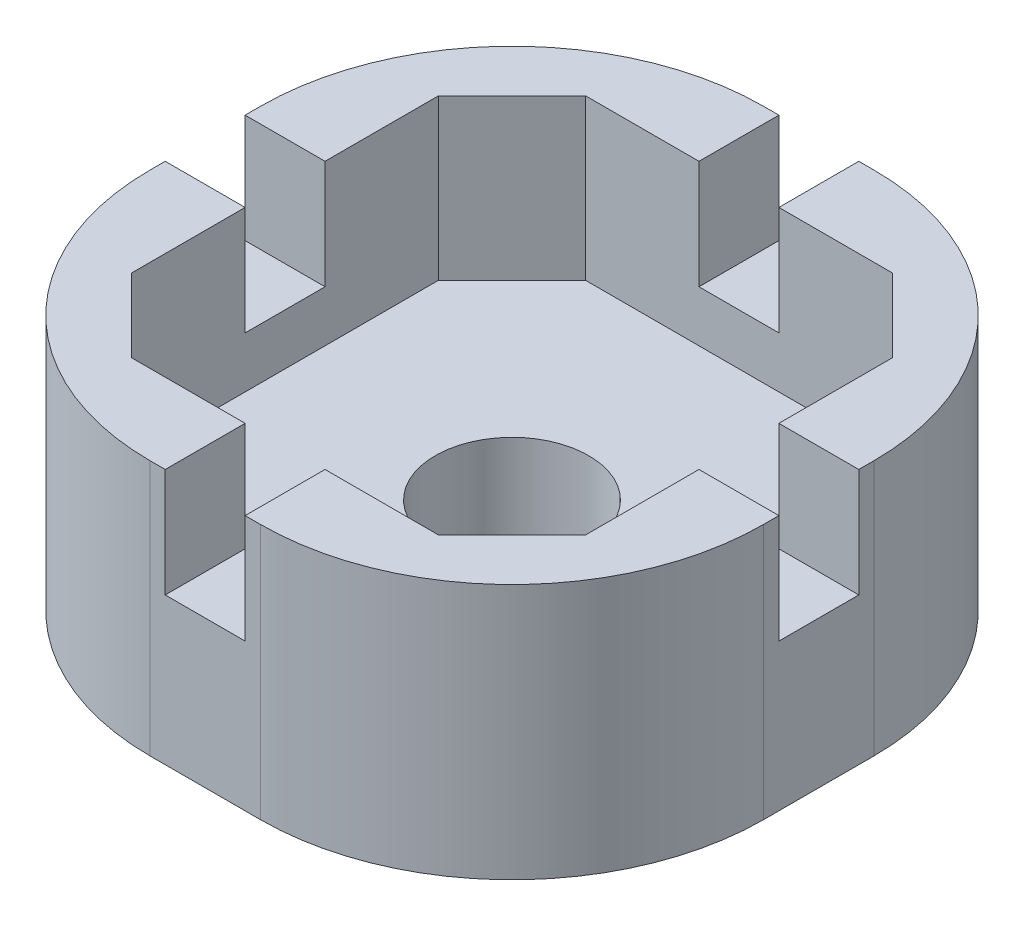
ISO-10303-21;
HEADER;
FILE_DESCRIPTION(('STEP AP214'),'2;1');
FILE_NAME('part.step','',(''),(''),'','','');
FILE_SCHEMA(('AUTOMOTIVE_DESIGN { 1 0 10303 214 1 1 1 1 }'));
ENDSEC;
DATA;
#1=APPLICATION_CONTEXT('core data for automotive mechanical design processes');
#2=APPLICATION_PROTOCOL_DEFINITION('international standard','automotive_design',2000,#1);
#3=PRODUCT_CONTEXT('',#1,'mechanical');
#4=PRODUCT('Part','Part','',(#3));
#5=PRODUCT_RELATED_PRODUCT_CATEGORY('part','',(#4));
#6=PRODUCT_DEFINITION_FORMATION('','',#4);
#7=PRODUCT_DEFINITION_CONTEXT('part definition',#1,'design');
#8=PRODUCT_DEFINITION('design','',#6,#7);
#9=PRODUCT_DEFINITION_SHAPE('','',#8);
#10=(LENGTH_UNIT() NAMED_UNIT(*) SI_UNIT(.MILLI.,.METRE.));
#11=(NAMED_UNIT(*) PLANE_ANGLE_UNIT() SI_UNIT($,.RADIAN.));
#12=(NAMED_UNIT(*) SI_UNIT($,.STERADIAN.) SOLID_ANGLE_UNIT());
#13=UNCERTAINTY_MEASURE_WITH_UNIT(LENGTH_MEASURE(1.E-05),#10,'distance_accuracy_value','');
#14=(GEOMETRIC_REPRESENTATION_CONTEXT(3) GLOBAL_UNCERTAINTY_ASSIGNED_CONTEXT((#13)) GLOBAL_UNIT_ASSIGNED_CONTEXT((#10,
#11,#12)) REPRESENTATION_CONTEXT('',''));
#15=CARTESIAN_POINT('',(0.,0.,0.));
#16=DIRECTION('',(0.,0.,1.));
#17=DIRECTION('',(1.,0.,0.));
#18=AXIS2_PLACEMENT_3D('',#15,#16,#17);
#19=CARTESIAN_POINT('',(0.,6.35,0.));
#20=DIRECTION('',(0.,1.,0.));
#21=DIRECTION('',(0.,0.,1.));
#22=AXIS2_PLACEMENT_3D('',#19,#20,#21);
#23=PLANE('',#22);
#24=DIRECTION('',(1.,0.,0.));
#25=VECTOR('',#24,1.);
#26=CARTESIAN_POINT('',(-12.192,6.35,12.1919999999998));
#27=LINE('',#26,#25);
#28=CARTESIAN_POINT('',(1.5875,6.35,12.1919999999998));
#29=VERTEX_POINT('',#28);
#30=CARTESIAN_POINT('',(2.192,6.35,12.1919999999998));
#31=VERTEX_POINT('',#30);
#32=EDGE_CURVE('E509',#29,#31,#27,.T.);
#33=ORIENTED_EDGE('',*,*,#32,.T.);
#34=CARTESIAN_POINT('',(2.192,6.35,2.19199999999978));
#35=DIRECTION('',(0.,1.,0.));
#36=DIRECTION('',(0.,0.,1.));
#37=AXIS2_PLACEMENT_3D('',#34,#35,#36);
#38=CIRCLE('',#37,10.);
#39=CARTESIAN_POINT('',(12.192,6.35,2.19199999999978));
#40=VERTEX_POINT('',#39);
#41=EDGE_CURVE('E11',#31,#40,#38,.T.);
#42=ORIENTED_EDGE('',*,*,#41,.T.);
#43=DIRECTION('',(0.,0.,-1.));
#44=VECTOR('',#43,1.);
#45=CARTESIAN_POINT('',(12.192,6.35,12.1919999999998));
#46=LINE('',#45,#44);
#47=CARTESIAN_POINT('',(12.192,6.35,1.5875));
#48=VERTEX_POINT('',#47);
#49=EDGE_CURVE('E514',#40,#48,#46,.T.);
#50=ORIENTED_EDGE('',*,*,#49,.T.);
#51=DIRECTION('',(-1.,0.,0.));
#52=VECTOR('',#51,1.);
#53=CARTESIAN_POINT('',(0.,6.35,1.5875));
#54=LINE('',#53,#52);
#55=CARTESIAN_POINT('',(9.017,6.35,1.5875));
#56=VERTEX_POINT('',#55);
#57=EDGE_CURVE('E304',#48,#56,#54,.T.);
#58=ORIENTED_EDGE('',*,*,#57,.T.);
#59=DIRECTION('',(0.,0.,-1.));
#60=VECTOR('',#59,1.);
#61=CARTESIAN_POINT('',(9.017,6.35,-6.096));
#62=LINE('',#61,#60);
#63=CARTESIAN_POINT('',(9.017,6.35,6.096));
#64=VERTEX_POINT('',#63);
#65=EDGE_CURVE('E441',#64,#56,#62,.T.);
#66=ORIENTED_EDGE('',*,*,#65,.F.);
#67=DIRECTION('',(0.70710678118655,0.,-0.707106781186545));
#68=VECTOR('',#67,1.);
#69=CARTESIAN_POINT('',(9.017,6.35,6.096));
#70=LINE('',#69,#68);
#71=CARTESIAN_POINT('',(6.096,6.35,9.01699999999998));
#72=VERTEX_POINT('',#71);
#73=EDGE_CURVE('E437',#72,#64,#70,.T.);
#74=ORIENTED_EDGE('',*,*,#73,.F.);
#75=DIRECTION('',(1.,0.,0.));
#76=VECTOR('',#75,1.);
#77=CARTESIAN_POINT('',(6.096,6.35,9.01699999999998));
#78=LINE('',#77,#76);
#79=CARTESIAN_POINT('',(1.5875,6.35,9.0169999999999));
#80=VERTEX_POINT('',#79);
#81=EDGE_CURVE('E434',#80,#72,#78,.T.);
#82=ORIENTED_EDGE('',*,*,#81,.F.);
#83=DIRECTION('',(0.,0.,1.));
#84=VECTOR('',#83,1.);
#85=CARTESIAN_POINT('',(1.5875,6.35,0.));
#86=LINE('',#85,#84);
#87=EDGE_CURVE('E272',#80,#29,#86,.T.);
#88=ORIENTED_EDGE('',*,*,#87,.T.);
#89=EDGE_LOOP('',(#33,#42,#50,#58,#66,#74,#82,#88));
#90=FACE_BOUND('',#89,.T.);
#91=ADVANCED_FACE('F39',(#90),#23,.T.);
#92=DIRECTION('',(0.,0.,1.));
#93=VECTOR('',#92,1.);
#94=CARTESIAN_POINT('',(-12.192,6.35,-12.1919999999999));
#95=LINE('',#94,#93);
#96=CARTESIAN_POINT('',(-12.192,6.35,1.5875));
#97=VERTEX_POINT('',#96);
#98=CARTESIAN_POINT('',(-12.192,6.35,2.19199999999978));
#99=VERTEX_POINT('',#98);
#100=EDGE_CURVE('E521',#97,#99,#95,.T.);
#101=ORIENTED_EDGE('',*,*,#100,.T.);
#102=CARTESIAN_POINT('',(-2.19199999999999,6.35,2.19199999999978));
#103=DIRECTION('',(0.,1.,0.));
#104=DIRECTION('',(0.,0.,1.));
#105=AXIS2_PLACEMENT_3D('',#102,#103,#104);
#106=CIRCLE('',#105,10.);
#107=CARTESIAN_POINT('',(-2.19199999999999,6.35,12.1919999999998));
#108=VERTEX_POINT('',#107);
#109=EDGE_CURVE('E48',#99,#108,#106,.T.);
#110=ORIENTED_EDGE('',*,*,#109,.T.);
#111=CARTESIAN_POINT('',(-1.5875,6.35,12.1919999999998));
#112=VERTEX_POINT('',#111);
#113=EDGE_CURVE('E510',#108,#112,#27,.T.);
#114=ORIENTED_EDGE('',*,*,#113,.T.);
#115=DIRECTION('',(0.,0.,1.));
#116=VECTOR('',#115,1.);
#117=CARTESIAN_POINT('',(-1.5875,6.35,0.));
#118=LINE('',#117,#116);
#119=CARTESIAN_POINT('',(-1.5875,6.35,9.01699999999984));
#120=VERTEX_POINT('',#119);
#121=EDGE_CURVE('E314',#120,#112,#118,.T.);
#122=ORIENTED_EDGE('',*,*,#121,.F.);
#123=CARTESIAN_POINT('',(-6.0960000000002,6.35,9.01699999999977));
#124=VERTEX_POINT('',#123);
#125=EDGE_CURVE('E278',#124,#120,#78,.T.);
#126=ORIENTED_EDGE('',*,*,#125,.F.);
#127=DIRECTION('',(0.707106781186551,0.,0.707106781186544));
#128=VECTOR('',#127,1.);
#129=CARTESIAN_POINT('',(-6.0960000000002,6.35,9.01699999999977));
#130=LINE('',#129,#128);
#131=CARTESIAN_POINT('',(-9.017,6.35,6.096));
#132=VERTEX_POINT('',#131);
#133=EDGE_CURVE('E431',#132,#124,#130,.T.);
#134=ORIENTED_EDGE('',*,*,#133,.F.);
#135=DIRECTION('',(0.,0.,1.));
#136=VECTOR('',#135,1.);
#137=CARTESIAN_POINT('',(-9.017,6.35,6.096));
#138=LINE('',#137,#136);
#139=CARTESIAN_POINT('',(-9.017,6.35,1.5875));
#140=VERTEX_POINT('',#139);
#141=EDGE_CURVE('E425',#140,#132,#138,.T.);
#142=ORIENTED_EDGE('',*,*,#141,.F.);
#143=DIRECTION('',(-1.,0.,0.));
#144=VECTOR('',#143,1.);
#145=CARTESIAN_POINT('',(0.,6.35,1.5875));
#146=LINE('',#145,#144);
#147=EDGE_CURVE('E342',#140,#97,#146,.T.);
#148=ORIENTED_EDGE('',*,*,#147,.T.);
#149=EDGE_LOOP('',(#101,#110,#114,#122,#126,#134,#142,#148));
#150=FACE_BOUND('',#149,.T.);
#151=ADVANCED_FACE('F671',(#150),#23,.T.);
#152=CARTESIAN_POINT('',(12.192,6.35,-1.5875));
#153=VERTEX_POINT('',#152);
#154=CARTESIAN_POINT('',(12.192,6.35,-2.19199999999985));
#155=VERTEX_POINT('',#154);
#156=EDGE_CURVE('E513',#153,#155,#46,.T.);
#157=ORIENTED_EDGE('',*,*,#156,.T.);
#158=CARTESIAN_POINT('',(2.192,6.35,-2.19199999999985));
#159=DIRECTION('',(0.,1.,0.));
#160=DIRECTION('',(0.,0.,1.));
#161=AXIS2_PLACEMENT_3D('',#158,#159,#160);
#162=CIRCLE('',#161,10.);
#163=CARTESIAN_POINT('',(2.19200000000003,6.35,-12.1919999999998));
#164=VERTEX_POINT('',#163);
#165=EDGE_CURVE('E551',#155,#164,#162,.T.);
#166=ORIENTED_EDGE('',*,*,#165,.T.);
#167=DIRECTION('',(-1.,0.,0.));
#168=VECTOR('',#167,1.);
#169=CARTESIAN_POINT('',(12.192,6.35,-12.1919999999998));
#170=LINE('',#169,#168);
#171=CARTESIAN_POINT('',(1.5875,6.35,-12.1919999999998));
#172=VERTEX_POINT('',#171);
#173=EDGE_CURVE('E518',#164,#172,#170,.T.);
#174=ORIENTED_EDGE('',*,*,#173,.T.);
#175=DIRECTION('',(0.,0.,1.));
#176=VECTOR('',#175,1.);
#177=CARTESIAN_POINT('',(1.5875,6.35,0.));
#178=LINE('',#177,#176);
#179=CARTESIAN_POINT('',(1.5875,6.35,-9.01699999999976));
#180=VERTEX_POINT('',#179);
#181=EDGE_CURVE('E367',#172,#180,#178,.T.);
#182=ORIENTED_EDGE('',*,*,#181,.T.);
#183=DIRECTION('',(-1.,0.,0.));
#184=VECTOR('',#183,1.);
#185=CARTESIAN_POINT('',(-6.0960000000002,6.35,-9.01699999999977));
#186=LINE('',#185,#184);
#187=CARTESIAN_POINT('',(6.096,6.35,-9.01699999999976));
#188=VERTEX_POINT('',#187);
#189=EDGE_CURVE('E450',#188,#180,#186,.T.);
#190=ORIENTED_EDGE('',*,*,#189,.F.);
#191=DIRECTION('',(-0.707106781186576,0.,-0.707106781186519));
#192=VECTOR('',#191,1.);
#193=CARTESIAN_POINT('',(6.096,6.35,-9.01699999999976));
#194=LINE('',#193,#192);
#195=CARTESIAN_POINT('',(9.017,6.35,-6.096));
#196=VERTEX_POINT('',#195);
#197=EDGE_CURVE('E445',#196,#188,#194,.T.);
#198=ORIENTED_EDGE('',*,*,#197,.F.);
#199=CARTESIAN_POINT('',(9.017,6.35,-1.5875));
#200=VERTEX_POINT('',#199);
#201=EDGE_CURVE('E440',#200,#196,#62,.T.);
#202=ORIENTED_EDGE('',*,*,#201,.F.);
#203=DIRECTION('',(-1.,0.,0.));
#204=VECTOR('',#203,1.);
#205=CARTESIAN_POINT('',(0.,6.35,-1.5875));
#206=LINE('',#205,#204);
#207=EDGE_CURVE('E292',#153,#200,#206,.T.);
#208=ORIENTED_EDGE('',*,*,#207,.F.);
#209=EDGE_LOOP('',(#157,#166,#174,#182,#190,#198,#202,#208));
#210=FACE_BOUND('',#209,.T.);
#211=ADVANCED_FACE('F618',(#210),#23,.T.);
#212=CARTESIAN_POINT('',(-1.5875,6.35,-12.1919999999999));
#213=VERTEX_POINT('',#212);
#214=CARTESIAN_POINT('',(-2.19199999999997,6.35,-12.1919999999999));
#215=VERTEX_POINT('',#214);
#216=EDGE_CURVE('E517',#213,#215,#170,.T.);
#217=ORIENTED_EDGE('',*,*,#216,.T.);
#218=CARTESIAN_POINT('',(-2.192,6.35,-2.19199999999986));
#219=DIRECTION('',(0.,1.,0.));
#220=DIRECTION('',(0.,0.,1.));
#221=AXIS2_PLACEMENT_3D('',#218,#219,#220);
#222=CIRCLE('',#221,10.);
#223=CARTESIAN_POINT('',(-12.192,6.35,-2.19199999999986));
#224=VERTEX_POINT('',#223);
#225=EDGE_CURVE('E561',#215,#224,#222,.T.);
#226=ORIENTED_EDGE('',*,*,#225,.T.);
#227=CARTESIAN_POINT('',(-12.192,6.35,-1.5875));
#228=VERTEX_POINT('',#227);
#229=EDGE_CURVE('E522',#224,#228,#95,.T.);
#230=ORIENTED_EDGE('',*,*,#229,.T.);
#231=DIRECTION('',(-1.,0.,0.));
#232=VECTOR('',#231,1.);
#233=CARTESIAN_POINT('',(0.,6.35,-1.5875));
#234=LINE('',#233,#232);
#235=CARTESIAN_POINT('',(-9.017,6.35,-1.5875));
#236=VERTEX_POINT('',#235);
#237=EDGE_CURVE('E329',#236,#228,#234,.T.);
#238=ORIENTED_EDGE('',*,*,#237,.F.);
#239=CARTESIAN_POINT('',(-9.017,6.35,-6.096));
#240=VERTEX_POINT('',#239);
#241=EDGE_CURVE('E427',#240,#236,#138,.T.);
#242=ORIENTED_EDGE('',*,*,#241,.F.);
#243=DIRECTION('',(-0.707106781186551,0.,0.707106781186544));
#244=VECTOR('',#243,1.);
#245=CARTESIAN_POINT('',(-9.017,6.35,-6.096));
#246=LINE('',#245,#244);
#247=CARTESIAN_POINT('',(-6.0960000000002,6.35,-9.01699999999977));
#248=VERTEX_POINT('',#247);
#249=EDGE_CURVE('E422',#248,#240,#246,.T.);
#250=ORIENTED_EDGE('',*,*,#249,.F.);
#251=CARTESIAN_POINT('',(-1.5875,6.35,-9.01699999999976));
#252=VERTEX_POINT('',#251);
#253=EDGE_CURVE('E449',#252,#248,#186,.T.);
#254=ORIENTED_EDGE('',*,*,#253,.F.);
#255=DIRECTION('',(0.,0.,1.));
#256=VECTOR('',#255,1.);
#257=CARTESIAN_POINT('',(-1.5875,6.35,0.));
#258=LINE('',#257,#256);
#259=EDGE_CURVE('E378',#213,#252,#258,.T.);
#260=ORIENTED_EDGE('',*,*,#259,.F.);
#261=EDGE_LOOP('',(#217,#226,#230,#238,#242,#250,#254,#260));
#262=FACE_BOUND('',#261,.T.);
#263=ADVANCED_FACE('F673',(#262),#23,.T.);
#264=CARTESIAN_POINT('',(-12.192,6.35,12.1919999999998));
#265=DIRECTION('',(0.,0.,-1.));
#266=DIRECTION('',(-1.,0.,0.));
#267=AXIS2_PLACEMENT_3D('',#264,#265,#266);
#268=PLANE('',#267);
#269=ORIENTED_EDGE('',*,*,#113,.F.);
#270=DIRECTION('',(0.,-1.,0.));
#271=VECTOR('',#270,1.);
#272=CARTESIAN_POINT('',(-2.19199999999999,6.35,12.1919999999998));
#273=LINE('',#272,#271);
#274=CARTESIAN_POINT('',(-2.19199999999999,-3.81,12.1919999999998));
#275=VERTEX_POINT('',#274);
#276=EDGE_CURVE('E566',#108,#275,#273,.T.);
#277=ORIENTED_EDGE('',*,*,#276,.T.);
#278=DIRECTION('',(-1.,0.,0.));
#279=VECTOR('',#278,1.);
#280=CARTESIAN_POINT('',(12.192,-3.81,12.1919999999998));
#281=LINE('',#280,#279);
#282=CARTESIAN_POINT('',(2.192,-3.81,12.1919999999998));
#283=VERTEX_POINT('',#282);
#284=EDGE_CURVE('E409',#283,#275,#281,.T.);
#285=ORIENTED_EDGE('',*,*,#284,.F.);
#286=DIRECTION('',(0.,-1.,0.));
#287=VECTOR('',#286,1.);
#288=CARTESIAN_POINT('',(2.192,6.35,12.1919999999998));
#289=LINE('',#288,#287);
#290=EDGE_CURVE('E55',#283,#31,#289,.F.);
#291=ORIENTED_EDGE('',*,*,#290,.T.);
#292=ORIENTED_EDGE('',*,*,#32,.F.);
#293=DIRECTION('',(0.,1.,0.));
#294=VECTOR('',#293,1.);
#295=CARTESIAN_POINT('',(1.5875,2.032,12.1919999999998));
#296=LINE('',#295,#294);
#297=CARTESIAN_POINT('',(1.5875,2.032,12.1919999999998));
#298=VERTEX_POINT('',#297);
#299=EDGE_CURVE('E283',#298,#29,#296,.T.);
#300=ORIENTED_EDGE('',*,*,#299,.F.);
#301=DIRECTION('',(1.,0.,0.));
#302=VECTOR('',#301,1.);
#303=CARTESIAN_POINT('',(0.,2.032,12.1919999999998));
#304=LINE('',#303,#302);
#305=CARTESIAN_POINT('',(-1.5875,2.032,12.1919999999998));
#306=VERTEX_POINT('',#305);
#307=EDGE_CURVE('E262',#306,#298,#304,.T.);
#308=ORIENTED_EDGE('',*,*,#307,.F.);
#309=DIRECTION('',(0.,1.,0.));
#310=VECTOR('',#309,1.);
#311=CARTESIAN_POINT('',(-1.5875,2.032,12.1919999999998));
#312=LINE('',#311,#310);
#313=EDGE_CURVE('E257',#306,#112,#312,.T.);
#314=ORIENTED_EDGE('',*,*,#313,.T.);
#315=EDGE_LOOP('',(#269,#277,#285,#291,#292,#300,#308,#314));
#316=FACE_BOUND('',#315,.T.);
#317=ADVANCED_FACE('F592',(#316),#268,.F.);
#318=CARTESIAN_POINT('',(12.192,6.35,12.1919999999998));
#319=DIRECTION('',(-1.,0.,0.));
#320=DIRECTION('',(0.,0.,1.));
#321=AXIS2_PLACEMENT_3D('',#318,#319,#320);
#322=PLANE('',#321);
#323=DIRECTION('',(0.,0.,1.));
#324=VECTOR('',#323,1.);
#325=CARTESIAN_POINT('',(12.192,-3.81,12.1919999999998));
#326=LINE('',#325,#324);
#327=CARTESIAN_POINT('',(12.192,-3.81,-2.19199999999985));
#328=VERTEX_POINT('',#327);
#329=CARTESIAN_POINT('',(12.192,-3.81,2.19199999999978));
#330=VERTEX_POINT('',#329);
#331=EDGE_CURVE('E400',#328,#330,#326,.T.);
#332=ORIENTED_EDGE('',*,*,#331,.F.);
#333=DIRECTION('',(0.,-1.,0.));
#334=VECTOR('',#333,1.);
#335=CARTESIAN_POINT('',(12.192,6.35,-2.19199999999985));
#336=LINE('',#335,#334);
#337=EDGE_CURVE('E548',#328,#155,#336,.F.);
#338=ORIENTED_EDGE('',*,*,#337,.T.);
#339=ORIENTED_EDGE('',*,*,#156,.F.);
#340=DIRECTION('',(0.,1.,0.));
#341=VECTOR('',#340,1.);
#342=CARTESIAN_POINT('',(12.192,2.032,-1.5875));
#343=LINE('',#342,#341);
#344=CARTESIAN_POINT('',(12.192,2.032,-1.5875));
#345=VERTEX_POINT('',#344);
#346=EDGE_CURVE('E319',#345,#153,#343,.T.);
#347=ORIENTED_EDGE('',*,*,#346,.F.);
#348=DIRECTION('',(0.,0.,-1.));
#349=VECTOR('',#348,1.);
#350=CARTESIAN_POINT('',(12.192,2.032,0.));
#351=LINE('',#350,#349);
#352=CARTESIAN_POINT('',(12.192,2.032,1.5875));
#353=VERTEX_POINT('',#352);
#354=EDGE_CURVE('E291',#353,#345,#351,.T.);
#355=ORIENTED_EDGE('',*,*,#354,.F.);
#356=DIRECTION('',(0.,1.,0.));
#357=VECTOR('',#356,1.);
#358=CARTESIAN_POINT('',(12.192,2.032,1.5875));
#359=LINE('',#358,#357);
#360=EDGE_CURVE('E303',#353,#48,#359,.T.);
#361=ORIENTED_EDGE('',*,*,#360,.T.);
#362=ORIENTED_EDGE('',*,*,#49,.F.);
#363=DIRECTION('',(0.,-1.,0.));
#364=VECTOR('',#363,1.);
#365=CARTESIAN_POINT('',(12.192,6.35,2.19199999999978));
#366=LINE('',#365,#364);
#367=EDGE_CURVE('E544',#40,#330,#366,.T.);
#368=ORIENTED_EDGE('',*,*,#367,.T.);
#369=EDGE_LOOP('',(#332,#338,#339,#347,#355,#361,#362,#368));
#370=FACE_BOUND('',#369,.T.);
#371=ADVANCED_FACE('F601',(#370),#322,.F.);
#372=CARTESIAN_POINT('',(12.192,6.35,-12.1919999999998));
#373=DIRECTION('',(0.,0.,1.));
#374=DIRECTION('',(1.,0.,0.));
#375=AXIS2_PLACEMENT_3D('',#372,#373,#374);
#376=PLANE('',#375);
#377=ORIENTED_EDGE('',*,*,#173,.F.);
#378=DIRECTION('',(0.,-1.,0.));
#379=VECTOR('',#378,1.);
#380=CARTESIAN_POINT('',(2.19200000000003,6.35,-12.1919999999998));
#381=LINE('',#380,#379);
#382=CARTESIAN_POINT('',(2.19200000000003,-3.81,-12.1919999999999));
#383=VERTEX_POINT('',#382);
#384=EDGE_CURVE('E528',#164,#383,#381,.T.);
#385=ORIENTED_EDGE('',*,*,#384,.T.);
#386=DIRECTION('',(1.,0.,0.));
#387=VECTOR('',#386,1.);
#388=CARTESIAN_POINT('',(12.192,-3.81,-12.1919999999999));
#389=LINE('',#388,#387);
#390=CARTESIAN_POINT('',(-2.19199999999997,-3.81,-12.1919999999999));
#391=VERTEX_POINT('',#390);
#392=EDGE_CURVE('E417',#391,#383,#389,.T.);
#393=ORIENTED_EDGE('',*,*,#392,.F.);
#394=DIRECTION('',(0.,-1.,0.));
#395=VECTOR('',#394,1.);
#396=CARTESIAN_POINT('',(-2.19199999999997,6.35,-12.1919999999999));
#397=LINE('',#396,#395);
#398=EDGE_CURVE('E525',#391,#215,#397,.F.);
#399=ORIENTED_EDGE('',*,*,#398,.T.);
#400=ORIENTED_EDGE('',*,*,#216,.F.);
#401=DIRECTION('',(0.,1.,0.));
#402=VECTOR('',#401,1.);
#403=CARTESIAN_POINT('',(-1.5875,2.032,-12.1919999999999));
#404=LINE('',#403,#402);
#405=CARTESIAN_POINT('',(-1.5875,2.032,-12.1919999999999));
#406=VERTEX_POINT('',#405);
#407=EDGE_CURVE('E377',#406,#213,#404,.T.);
#408=ORIENTED_EDGE('',*,*,#407,.F.);
#409=DIRECTION('',(-1.,0.,0.));
#410=VECTOR('',#409,1.);
#411=CARTESIAN_POINT('',(0.,2.032,-12.1919999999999));
#412=LINE('',#411,#410);
#413=CARTESIAN_POINT('',(1.5875,2.032,-12.1919999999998));
#414=VERTEX_POINT('',#413);
#415=EDGE_CURVE('E362',#414,#406,#412,.T.);
#416=ORIENTED_EDGE('',*,*,#415,.F.);
#417=DIRECTION('',(0.,1.,0.));
#418=VECTOR('',#417,1.);
#419=CARTESIAN_POINT('',(1.5875,2.032,-12.1919999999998));
#420=LINE('',#419,#418);
#421=EDGE_CURVE('E346',#414,#172,#420,.T.);
#422=ORIENTED_EDGE('',*,*,#421,.T.);
#423=EDGE_LOOP('',(#377,#385,#393,#399,#400,#408,#416,#422));
#424=FACE_BOUND('',#423,.T.);
#425=ADVANCED_FACE('F613',(#424),#376,.F.);
#426=CARTESIAN_POINT('',(-12.192,6.35,-12.1919999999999));
#427=DIRECTION('',(1.,0.,0.));
#428=DIRECTION('',(0.,0.,-1.));
#429=AXIS2_PLACEMENT_3D('',#426,#427,#428);
#430=PLANE('',#429);
#431=ORIENTED_EDGE('',*,*,#229,.F.);
#432=DIRECTION('',(0.,-1.,0.));
#433=VECTOR('',#432,1.);
#434=CARTESIAN_POINT('',(-12.192,6.35,-2.19199999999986));
#435=LINE('',#434,#433);
#436=CARTESIAN_POINT('',(-12.192,-3.81,-2.19199999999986));
#437=VERTEX_POINT('',#436);
#438=EDGE_CURVE('E557',#224,#437,#435,.T.);
#439=ORIENTED_EDGE('',*,*,#438,.T.);
#440=DIRECTION('',(0.,0.,-1.));
#441=VECTOR('',#440,1.);
#442=CARTESIAN_POINT('',(-12.192,-3.81,12.1919999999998));
#443=LINE('',#442,#441);
#444=CARTESIAN_POINT('',(-12.192,-3.81,2.19199999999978));
#445=VERTEX_POINT('',#444);
#446=EDGE_CURVE('E413',#445,#437,#443,.T.);
#447=ORIENTED_EDGE('',*,*,#446,.F.);
#448=DIRECTION('',(0.,-1.,0.));
#449=VECTOR('',#448,1.);
#450=CARTESIAN_POINT('',(-12.192,6.35,2.19199999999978));
#451=LINE('',#450,#449);
#452=EDGE_CURVE('E554',#445,#99,#451,.F.);
#453=ORIENTED_EDGE('',*,*,#452,.T.);
#454=ORIENTED_EDGE('',*,*,#100,.F.);
#455=DIRECTION('',(0.,1.,0.));
#456=VECTOR('',#455,1.);
#457=CARTESIAN_POINT('',(-12.192,2.032,1.5875));
#458=LINE('',#457,#456);
#459=CARTESIAN_POINT('',(-12.192,2.032,1.5875));
#460=VERTEX_POINT('',#459);
#461=EDGE_CURVE('E308',#460,#97,#458,.T.);
#462=ORIENTED_EDGE('',*,*,#461,.F.);
#463=DIRECTION('',(0.,0.,1.));
#464=VECTOR('',#463,1.);
#465=CARTESIAN_POINT('',(-12.192,2.032,0.));
#466=LINE('',#465,#464);
#467=CARTESIAN_POINT('',(-12.192,2.032,-1.5875));
#468=VERTEX_POINT('',#467);
#469=EDGE_CURVE('E337',#468,#460,#466,.T.);
#470=ORIENTED_EDGE('',*,*,#469,.F.);
#471=DIRECTION('',(0.,1.,0.));
#472=VECTOR('',#471,1.);
#473=CARTESIAN_POINT('',(-12.192,2.032,-1.5875));
#474=LINE('',#473,#472);
#475=EDGE_CURVE('E352',#468,#228,#474,.T.);
#476=ORIENTED_EDGE('',*,*,#475,.T.);
#477=EDGE_LOOP('',(#431,#439,#447,#453,#454,#462,#470,#476));
#478=FACE_BOUND('',#477,.T.);
#479=ADVANCED_FACE('F697',(#478),#430,.F.);
#480=CARTESIAN_POINT('',(-9.017,6.35,6.096));
#481=DIRECTION('',(1.,0.,0.));
#482=DIRECTION('',(0.,0.,-1.));
#483=AXIS2_PLACEMENT_3D('',#480,#481,#482);
#484=PLANE('',#483);
#485=DIRECTION('',(0.,0.,-1.));
#486=VECTOR('',#485,1.);
#487=CARTESIAN_POINT('',(-9.017,2.032,0.));
#488=LINE('',#487,#486);
#489=CARTESIAN_POINT('',(-9.017,2.032,1.5875));
#490=VERTEX_POINT('',#489);
#491=CARTESIAN_POINT('',(-9.017,2.032,-1.5875));
#492=VERTEX_POINT('',#491);
#493=EDGE_CURVE('E328',#490,#492,#488,.T.);
#494=ORIENTED_EDGE('',*,*,#493,.F.);
#495=DIRECTION('',(0.,1.,0.));
#496=VECTOR('',#495,1.);
#497=CARTESIAN_POINT('',(-9.017,2.032,1.5875));
#498=LINE('',#497,#496);
#499=EDGE_CURVE('E341',#490,#140,#498,.T.);
#500=ORIENTED_EDGE('',*,*,#499,.T.);
#501=ORIENTED_EDGE('',*,*,#141,.T.);
#502=DIRECTION('',(0.,-1.,0.));
#503=VECTOR('',#502,1.);
#504=CARTESIAN_POINT('',(-9.017,6.35,6.096));
#505=LINE('',#504,#503);
#506=CARTESIAN_POINT('',(-9.017,0.,6.096));
#507=VERTEX_POINT('',#506);
#508=EDGE_CURVE('E502',#132,#507,#505,.T.);
#509=ORIENTED_EDGE('',*,*,#508,.T.);
#510=DIRECTION('',(0.,0.,1.));
#511=VECTOR('',#510,1.);
#512=CARTESIAN_POINT('',(-9.017,0.,6.096));
#513=LINE('',#512,#511);
#514=CARTESIAN_POINT('',(-9.017,0.,-6.096));
#515=VERTEX_POINT('',#514);
#516=EDGE_CURVE('E458',#515,#507,#513,.T.);
#517=ORIENTED_EDGE('',*,*,#516,.F.);
#518=DIRECTION('',(0.,-1.,0.));
#519=VECTOR('',#518,1.);
#520=CARTESIAN_POINT('',(-9.017,6.35,-6.096));
#521=LINE('',#520,#519);
#522=EDGE_CURVE('E505',#240,#515,#521,.T.);
#523=ORIENTED_EDGE('',*,*,#522,.F.);
#524=ORIENTED_EDGE('',*,*,#241,.T.);
#525=DIRECTION('',(0.,1.,0.));
#526=VECTOR('',#525,1.);
#527=CARTESIAN_POINT('',(-9.017,2.032,-1.5875));
#528=LINE('',#527,#526);
#529=EDGE_CURVE('E356',#492,#236,#528,.T.);
#530=ORIENTED_EDGE('',*,*,#529,.F.);
#531=EDGE_LOOP('',(#494,#500,#501,#509,#517,#523,#524,#530));
#532=FACE_BOUND('',#531,.T.);
#533=ADVANCED_FACE('F715',(#532),#484,.T.);
#534=CARTESIAN_POINT('',(6.096,6.35,9.01699999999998));
#535=DIRECTION('',(0.,0.,-1.));
#536=DIRECTION('',(-1.,0.,0.));
#537=AXIS2_PLACEMENT_3D('',#534,#535,#536);
#538=PLANE('',#537);
#539=DIRECTION('',(-1.,0.,0.));
#540=VECTOR('',#539,1.);
#541=CARTESIAN_POINT('',(-1.53956708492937E-13,2.032,9.01699999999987));
#542=LINE('',#541,#540);
#543=CARTESIAN_POINT('',(1.5875,2.032,9.0169999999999));
#544=VERTEX_POINT('',#543);
#545=CARTESIAN_POINT('',(-1.5875,2.032,9.01699999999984));
#546=VERTEX_POINT('',#545);
#547=EDGE_CURVE('E263',#544,#546,#542,.T.);
#548=ORIENTED_EDGE('',*,*,#547,.F.);
#549=DIRECTION('',(0.,1.,0.));
#550=VECTOR('',#549,1.);
#551=CARTESIAN_POINT('',(1.5875,2.032,9.0169999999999));
#552=LINE('',#551,#550);
#553=EDGE_CURVE('E405',#544,#80,#552,.T.);
#554=ORIENTED_EDGE('',*,*,#553,.T.);
#555=ORIENTED_EDGE('',*,*,#81,.T.);
#556=DIRECTION('',(0.,-1.,0.));
#557=VECTOR('',#556,1.);
#558=CARTESIAN_POINT('',(6.096,6.35,9.01699999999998));
#559=LINE('',#558,#557);
#560=CARTESIAN_POINT('',(6.096,0.,9.01699999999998));
#561=VERTEX_POINT('',#560);
#562=EDGE_CURVE('E496',#72,#561,#559,.T.);
#563=ORIENTED_EDGE('',*,*,#562,.T.);
#564=DIRECTION('',(1.,0.,0.));
#565=VECTOR('',#564,1.);
#566=CARTESIAN_POINT('',(6.096,0.,9.01699999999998));
#567=LINE('',#566,#565);
#568=CARTESIAN_POINT('',(-6.0960000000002,0.,9.01699999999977));
#569=VERTEX_POINT('',#568);
#570=EDGE_CURVE('E466',#569,#561,#567,.T.);
#571=ORIENTED_EDGE('',*,*,#570,.F.);
#572=DIRECTION('',(0.,-1.,0.));
#573=VECTOR('',#572,1.);
#574=CARTESIAN_POINT('',(-6.0960000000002,6.35,9.01699999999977));
#575=LINE('',#574,#573);
#576=EDGE_CURVE('E499',#124,#569,#575,.T.);
#577=ORIENTED_EDGE('',*,*,#576,.F.);
#578=ORIENTED_EDGE('',*,*,#125,.T.);
#579=DIRECTION('',(0.,1.,0.));
#580=VECTOR('',#579,1.);
#581=CARTESIAN_POINT('',(-1.5875,2.032,9.01699999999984));
#582=LINE('',#581,#580);
#583=EDGE_CURVE('E254',#546,#120,#582,.T.);
#584=ORIENTED_EDGE('',*,*,#583,.F.);
#585=EDGE_LOOP('',(#548,#554,#555,#563,#571,#577,#578,#584));
#586=FACE_BOUND('',#585,.T.);
#587=ADVANCED_FACE('F275',(#586),#538,.T.);
#588=CARTESIAN_POINT('',(9.017,6.35,-6.096));
#589=DIRECTION('',(-1.,0.,0.));
#590=DIRECTION('',(0.,0.,1.));
#591=AXIS2_PLACEMENT_3D('',#588,#589,#590);
#592=PLANE('',#591);
#593=ORIENTED_EDGE('',*,*,#65,.T.);
#594=DIRECTION('',(0.,1.,0.));
#595=VECTOR('',#594,1.);
#596=CARTESIAN_POINT('',(9.017,2.032,1.5875));
#597=LINE('',#596,#595);
#598=CARTESIAN_POINT('',(9.017,2.032,1.5875));
#599=VERTEX_POINT('',#598);
#600=EDGE_CURVE('E311',#599,#56,#597,.T.);
#601=ORIENTED_EDGE('',*,*,#600,.F.);
#602=DIRECTION('',(0.,0.,1.));
#603=VECTOR('',#602,1.);
#604=CARTESIAN_POINT('',(9.017,2.032,0.));
#605=LINE('',#604,#603);
#606=CARTESIAN_POINT('',(9.017,2.032,-1.5875));
#607=VERTEX_POINT('',#606);
#608=EDGE_CURVE('E299',#607,#599,#605,.T.);
#609=ORIENTED_EDGE('',*,*,#608,.F.);
#610=DIRECTION('',(0.,1.,0.));
#611=VECTOR('',#610,1.);
#612=CARTESIAN_POINT('',(9.017,2.032,-1.5875));
#613=LINE('',#612,#611);
#614=EDGE_CURVE('E315',#607,#200,#613,.T.);
#615=ORIENTED_EDGE('',*,*,#614,.T.);
#616=ORIENTED_EDGE('',*,*,#201,.T.);
#617=DIRECTION('',(0.,-1.,0.));
#618=VECTOR('',#617,1.);
#619=CARTESIAN_POINT('',(9.017,6.35,-6.096));
#620=LINE('',#619,#618);
#621=CARTESIAN_POINT('',(9.017,0.,-6.096));
#622=VERTEX_POINT('',#621);
#623=EDGE_CURVE('E490',#196,#622,#620,.T.);
#624=ORIENTED_EDGE('',*,*,#623,.T.);
#625=DIRECTION('',(0.,0.,-1.));
#626=VECTOR('',#625,1.);
#627=CARTESIAN_POINT('',(9.017,0.,-6.096));
#628=LINE('',#627,#626);
#629=CARTESIAN_POINT('',(9.017,0.,6.096));
#630=VERTEX_POINT('',#629);
#631=EDGE_CURVE('E474',#630,#622,#628,.T.);
#632=ORIENTED_EDGE('',*,*,#631,.F.);
#633=DIRECTION('',(0.,-1.,0.));
#634=VECTOR('',#633,1.);
#635=CARTESIAN_POINT('',(9.017,6.35,6.096));
#636=LINE('',#635,#634);
#637=EDGE_CURVE('E493',#64,#630,#636,.T.);
#638=ORIENTED_EDGE('',*,*,#637,.F.);
#639=EDGE_LOOP('',(#593,#601,#609,#615,#616,#624,#632,#638));
#640=FACE_BOUND('',#639,.T.);
#641=ADVANCED_FACE('F637',(#640),#592,.T.);
#642=CARTESIAN_POINT('',(-6.0960000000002,6.35,-9.01699999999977));
#643=DIRECTION('',(0.,0.,1.));
#644=DIRECTION('',(1.,0.,0.));
#645=AXIS2_PLACEMENT_3D('',#642,#643,#644);
#646=PLANE('',#645);
#647=ORIENTED_EDGE('',*,*,#189,.T.);
#648=DIRECTION('',(0.,1.,0.));
#649=VECTOR('',#648,1.);
#650=CARTESIAN_POINT('',(1.5875,2.032,-9.01699999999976));
#651=LINE('',#650,#649);
#652=CARTESIAN_POINT('',(1.5875,2.032,-9.01699999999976));
#653=VERTEX_POINT('',#652);
#654=EDGE_CURVE('E387',#653,#180,#651,.T.);
#655=ORIENTED_EDGE('',*,*,#654,.F.);
#656=DIRECTION('',(1.,0.,0.));
#657=VECTOR('',#656,1.);
#658=CARTESIAN_POINT('',(0.,2.032,-9.01699999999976));
#659=LINE('',#658,#657);
#660=CARTESIAN_POINT('',(-1.5875,2.032,-9.01699999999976));
#661=VERTEX_POINT('',#660);
#662=EDGE_CURVE('E370',#661,#653,#659,.T.);
#663=ORIENTED_EDGE('',*,*,#662,.F.);
#664=DIRECTION('',(0.,1.,0.));
#665=VECTOR('',#664,1.);
#666=CARTESIAN_POINT('',(-1.5875,2.032,-9.01699999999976));
#667=LINE('',#666,#665);
#668=EDGE_CURVE('E390',#661,#252,#667,.T.);
#669=ORIENTED_EDGE('',*,*,#668,.T.);
#670=ORIENTED_EDGE('',*,*,#253,.T.);
#671=DIRECTION('',(0.,-1.,0.));
#672=VECTOR('',#671,1.);
#673=CARTESIAN_POINT('',(-6.0960000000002,6.35,-9.01699999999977));
#674=LINE('',#673,#672);
#675=CARTESIAN_POINT('',(-6.0960000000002,0.,-9.01699999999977));
#676=VERTEX_POINT('',#675);
#677=EDGE_CURVE('E454',#248,#676,#674,.T.);
#678=ORIENTED_EDGE('',*,*,#677,.T.);
#679=DIRECTION('',(-1.,0.,0.));
#680=VECTOR('',#679,1.);
#681=CARTESIAN_POINT('',(-6.0960000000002,0.,-9.01699999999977));
#682=LINE('',#681,#680);
#683=CARTESIAN_POINT('',(6.096,0.,-9.01699999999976));
#684=VERTEX_POINT('',#683);
#685=EDGE_CURVE('E426',#684,#676,#682,.T.);
#686=ORIENTED_EDGE('',*,*,#685,.F.);
#687=DIRECTION('',(0.,-1.,0.));
#688=VECTOR('',#687,1.);
#689=CARTESIAN_POINT('',(6.096,6.35,-9.01699999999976));
#690=LINE('',#689,#688);
#691=EDGE_CURVE('E487',#188,#684,#690,.T.);
#692=ORIENTED_EDGE('',*,*,#691,.F.);
#693=EDGE_LOOP('',(#647,#655,#663,#669,#670,#678,#686,#692));
#694=FACE_BOUND('',#693,.T.);
#695=ADVANCED_FACE('F626',(#694),#646,.T.);
#696=CARTESIAN_POINT('',(-9.017,6.35,-6.096));
#697=DIRECTION('',(0.707106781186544,0.,0.707106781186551));
#698=DIRECTION('',(0.707106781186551,0.,-0.707106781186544));
#699=AXIS2_PLACEMENT_3D('',#696,#697,#698);
#700=PLANE('',#699);
#701=DIRECTION('',(-0.707106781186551,0.,0.707106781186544));
#702=VECTOR('',#701,1.);
#703=CARTESIAN_POINT('',(-9.017,0.,-6.096));
#704=LINE('',#703,#702);
#705=EDGE_CURVE('E421',#676,#515,#704,.T.);
#706=ORIENTED_EDGE('',*,*,#705,.F.);
#707=ORIENTED_EDGE('',*,*,#677,.F.);
#708=ORIENTED_EDGE('',*,*,#249,.T.);
#709=ORIENTED_EDGE('',*,*,#522,.T.);
#710=EDGE_LOOP('',(#706,#707,#708,#709));
#711=FACE_BOUND('',#710,.T.);
#712=ADVANCED_FACE('F718',(#711),#700,.T.);
#713=CARTESIAN_POINT('',(-6.0960000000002,6.35,9.01699999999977));
#714=DIRECTION('',(0.707106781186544,0.,-0.707106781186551));
#715=DIRECTION('',(-0.707106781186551,0.,-0.707106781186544));
#716=AXIS2_PLACEMENT_3D('',#713,#714,#715);
#717=PLANE('',#716);
#718=DIRECTION('',(0.707106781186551,0.,0.707106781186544));
#719=VECTOR('',#718,1.);
#720=CARTESIAN_POINT('',(-6.0960000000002,0.,9.01699999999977));
#721=LINE('',#720,#719);
#722=EDGE_CURVE('E462',#507,#569,#721,.T.);
#723=ORIENTED_EDGE('',*,*,#722,.F.);
#724=ORIENTED_EDGE('',*,*,#508,.F.);
#725=ORIENTED_EDGE('',*,*,#133,.T.);
#726=ORIENTED_EDGE('',*,*,#576,.T.);
#727=EDGE_LOOP('',(#723,#724,#725,#726));
#728=FACE_BOUND('',#727,.T.);
#729=ADVANCED_FACE('F707',(#728),#717,.T.);
#730=CARTESIAN_POINT('',(9.017,6.35,6.096));
#731=DIRECTION('',(-0.707106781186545,0.,-0.70710678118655));
#732=DIRECTION('',(-0.70710678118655,0.,0.707106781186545));
#733=AXIS2_PLACEMENT_3D('',#730,#731,#732);
#734=PLANE('',#733);
#735=DIRECTION('',(0.70710678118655,0.,-0.707106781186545));
#736=VECTOR('',#735,1.);
#737=CARTESIAN_POINT('',(9.017,0.,6.096));
#738=LINE('',#737,#736);
#739=EDGE_CURVE('E470',#561,#630,#738,.T.);
#740=ORIENTED_EDGE('',*,*,#739,.F.);
#741=ORIENTED_EDGE('',*,*,#562,.F.);
#742=ORIENTED_EDGE('',*,*,#73,.T.);
#743=ORIENTED_EDGE('',*,*,#637,.T.);
#744=EDGE_LOOP('',(#740,#741,#742,#743));
#745=FACE_BOUND('',#744,.T.);
#746=ADVANCED_FACE('F657',(#745),#734,.T.);
#747=CARTESIAN_POINT('',(6.096,6.35,-9.01699999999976));
#748=DIRECTION('',(-0.707106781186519,0.,0.707106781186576));
#749=DIRECTION('',(0.707106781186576,0.,0.707106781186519));
#750=AXIS2_PLACEMENT_3D('',#747,#748,#749);
#751=PLANE('',#750);
#752=DIRECTION('',(-0.707106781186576,0.,-0.707106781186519));
#753=VECTOR('',#752,1.);
#754=CARTESIAN_POINT('',(6.096,0.,-9.01699999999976));
#755=LINE('',#754,#753);
#756=EDGE_CURVE('E478',#622,#684,#755,.T.);
#757=ORIENTED_EDGE('',*,*,#756,.F.);
#758=ORIENTED_EDGE('',*,*,#623,.F.);
#759=ORIENTED_EDGE('',*,*,#197,.T.);
#760=ORIENTED_EDGE('',*,*,#691,.T.);
#761=EDGE_LOOP('',(#757,#758,#759,#760));
#762=FACE_BOUND('',#761,.T.);
#763=ADVANCED_FACE('F634',(#762),#751,.T.);
#764=CARTESIAN_POINT('',(0.,-3.81,0.));
#765=DIRECTION('',(0.,1.,0.));
#766=DIRECTION('',(0.,0.,1.));
#767=AXIS2_PLACEMENT_3D('',#764,#765,#766);
#768=PLANE('',#767);
#769=ORIENTED_EDGE('',*,*,#392,.T.);
#770=CARTESIAN_POINT('',(2.192,-3.81,-2.19199999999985));
#771=DIRECTION('',(0.,1.,0.));
#772=DIRECTION('',(0.,0.,1.));
#773=AXIS2_PLACEMENT_3D('',#770,#771,#772);
#774=CIRCLE('',#773,10.);
#775=EDGE_CURVE('E541',#383,#328,#774,.F.);
#776=ORIENTED_EDGE('',*,*,#775,.T.);
#777=ORIENTED_EDGE('',*,*,#331,.T.);
#778=CARTESIAN_POINT('',(2.192,-3.81,2.19199999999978));
#779=DIRECTION('',(0.,1.,0.));
#780=DIRECTION('',(0.,0.,1.));
#781=AXIS2_PLACEMENT_3D('',#778,#779,#780);
#782=CIRCLE('',#781,10.);
#783=EDGE_CURVE('E532',#330,#283,#782,.F.);
#784=ORIENTED_EDGE('',*,*,#783,.T.);
#785=ORIENTED_EDGE('',*,*,#284,.T.);
#786=CARTESIAN_POINT('',(-2.19199999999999,-3.81,2.19199999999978));
#787=DIRECTION('',(0.,1.,0.));
#788=DIRECTION('',(0.,0.,1.));
#789=AXIS2_PLACEMENT_3D('',#786,#787,#788);
#790=CIRCLE('',#789,10.);
#791=EDGE_CURVE('E535',#275,#445,#790,.F.);
#792=ORIENTED_EDGE('',*,*,#791,.T.);
#793=ORIENTED_EDGE('',*,*,#446,.T.);
#794=CARTESIAN_POINT('',(-2.192,-3.81,-2.19199999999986));
#795=DIRECTION('',(0.,1.,0.));
#796=DIRECTION('',(0.,0.,1.));
#797=AXIS2_PLACEMENT_3D('',#794,#795,#796);
#798=CIRCLE('',#797,10.);
#799=EDGE_CURVE('E538',#437,#391,#798,.F.);
#800=ORIENTED_EDGE('',*,*,#799,.T.);
#801=EDGE_LOOP('',(#769,#776,#777,#784,#785,#792,#793,#800));
#802=FACE_BOUND('',#801,.T.);
#803=CARTESIAN_POINT('',(0.,-3.81,0.));
#804=DIRECTION('',(0.,-1.,0.));
#805=DIRECTION('',(0.,0.,-1.));
#806=AXIS2_PLACEMENT_3D('',#803,#804,#805);
#807=CIRCLE('',#806,3.048);
#808=CARTESIAN_POINT('',(0.,-3.81,3.04799999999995));
#809=VERTEX_POINT('',#808);
#810=EDGE_CURVE('E396',#809,#809,#807,.T.);
#811=ORIENTED_EDGE('',*,*,#810,.F.);
#812=EDGE_LOOP('',(#811));
#813=FACE_BOUND('',#812,.T.);
#814=ADVANCED_FACE('F604',(#802,#813),#768,.F.);
#815=CARTESIAN_POINT('',(0.,0.,0.));
#816=DIRECTION('',(0.,1.,0.));
#817=DIRECTION('',(0.,0.,1.));
#818=AXIS2_PLACEMENT_3D('',#815,#816,#817);
#819=PLANE('',#818);
#820=ORIENTED_EDGE('',*,*,#685,.T.);
#821=ORIENTED_EDGE('',*,*,#705,.T.);
#822=ORIENTED_EDGE('',*,*,#516,.T.);
#823=ORIENTED_EDGE('',*,*,#722,.T.);
#824=ORIENTED_EDGE('',*,*,#570,.T.);
#825=ORIENTED_EDGE('',*,*,#739,.T.);
#826=ORIENTED_EDGE('',*,*,#631,.T.);
#827=ORIENTED_EDGE('',*,*,#756,.T.);
#828=EDGE_LOOP('',(#820,#821,#822,#823,#824,#825,#826,#827));
#829=FACE_BOUND('',#828,.T.);
#830=CARTESIAN_POINT('',(0.,0.,0.));
#831=DIRECTION('',(0.,-1.,0.));
#832=DIRECTION('',(0.,0.,-1.));
#833=AXIS2_PLACEMENT_3D('',#830,#831,#832);
#834=CIRCLE('',#833,3.048);
#835=CARTESIAN_POINT('',(0.,0.,3.04799999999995));
#836=VERTEX_POINT('',#835);
#837=EDGE_CURVE('E401',#836,#836,#834,.T.);
#838=ORIENTED_EDGE('',*,*,#837,.T.);
#839=EDGE_LOOP('',(#838));
#840=FACE_BOUND('',#839,.T.);
#841=ADVANCED_FACE('F709',(#829,#840),#819,.T.);
#842=CARTESIAN_POINT('',(0.,-3.81,0.));
#843=DIRECTION('',(0.,1.,0.));
#844=DIRECTION('',(0.,0.,1.));
#845=AXIS2_PLACEMENT_3D('',#842,#843,#844);
#846=CYLINDRICAL_SURFACE('',#845,3.048);
#847=CARTESIAN_POINT('',(0.,-3.81,3.04799999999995));
#848=CARTESIAN_POINT('',(0.,-3.7703125,3.04799999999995));
#849=CARTESIAN_POINT('',(0.,-3.730625,3.04799999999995));
#850=CARTESIAN_POINT('',(0.,-3.65125,3.04799999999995));
#851=CARTESIAN_POINT('',(0.,-3.6115625,3.04799999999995));
#852=CARTESIAN_POINT('',(0.,-3.5321875,3.04799999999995));
#853=CARTESIAN_POINT('',(0.,-3.4925,3.04799999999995));
#854=CARTESIAN_POINT('',(0.,-3.413125,3.04799999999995));
#855=CARTESIAN_POINT('',(0.,-3.3734375,3.04799999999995));
#856=CARTESIAN_POINT('',(0.,-3.2940625,3.04799999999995));
#857=CARTESIAN_POINT('',(0.,-3.254375,3.04799999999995));
#858=CARTESIAN_POINT('',(0.,-3.175,3.04799999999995));
#859=CARTESIAN_POINT('',(0.,-3.1353125,3.04799999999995));
#860=CARTESIAN_POINT('',(0.,-3.0559375,3.04799999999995));
#861=CARTESIAN_POINT('',(0.,-3.01625,3.04799999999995));
#862=CARTESIAN_POINT('',(0.,-2.936875,3.04799999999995));
#863=CARTESIAN_POINT('',(0.,-2.8971875,3.04799999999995));
#864=CARTESIAN_POINT('',(0.,-2.8178125,3.04799999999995));
#865=CARTESIAN_POINT('',(0.,-2.778125,3.04799999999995));
#866=CARTESIAN_POINT('',(0.,-2.69875,3.04799999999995));
#867=CARTESIAN_POINT('',(0.,-2.6590625,3.04799999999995));
#868=CARTESIAN_POINT('',(0.,-2.5796875,3.04799999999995));
#869=CARTESIAN_POINT('',(0.,-2.54,3.04799999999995));
#870=CARTESIAN_POINT('',(0.,-2.460625,3.04799999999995));
#871=CARTESIAN_POINT('',(0.,-2.4209375,3.04799999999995));
#872=CARTESIAN_POINT('',(0.,-2.3415625,3.04799999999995));
#873=CARTESIAN_POINT('',(0.,-2.301875,3.04799999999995));
#874=CARTESIAN_POINT('',(0.,-2.2225,3.04799999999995));
#875=CARTESIAN_POINT('',(0.,-2.1828125,3.04799999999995));
#876=CARTESIAN_POINT('',(0.,-2.1034375,3.04799999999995));
#877=CARTESIAN_POINT('',(0.,-2.06375,3.04799999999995));
#878=CARTESIAN_POINT('',(0.,-1.984375,3.04799999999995));
#879=CARTESIAN_POINT('',(0.,-1.9446875,3.04799999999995));
#880=CARTESIAN_POINT('',(0.,-1.8653125,3.04799999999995));
#881=CARTESIAN_POINT('',(0.,-1.825625,3.04799999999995));
#882=CARTESIAN_POINT('',(0.,-1.74625,3.04799999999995));
#883=CARTESIAN_POINT('',(0.,-1.7065625,3.04799999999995));
#884=CARTESIAN_POINT('',(0.,-1.6271875,3.04799999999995));
#885=CARTESIAN_POINT('',(0.,-1.5875,3.04799999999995));
#886=CARTESIAN_POINT('',(0.,-1.508125,3.04799999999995));
#887=CARTESIAN_POINT('',(0.,-1.4684375,3.04799999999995));
#888=CARTESIAN_POINT('',(0.,-1.3890625,3.04799999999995));
#889=CARTESIAN_POINT('',(0.,-1.349375,3.04799999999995));
#890=CARTESIAN_POINT('',(0.,-1.27,3.04799999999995));
#891=CARTESIAN_POINT('',(0.,-1.2303125,3.04799999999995));
#892=CARTESIAN_POINT('',(0.,-1.1509375,3.04799999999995));
#893=CARTESIAN_POINT('',(0.,-1.11125,3.04799999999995));
#894=CARTESIAN_POINT('',(0.,-1.031875,3.04799999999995));
#895=CARTESIAN_POINT('',(0.,-0.9921875,3.04799999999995));
#896=CARTESIAN_POINT('',(0.,-0.9128125,3.04799999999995));
#897=CARTESIAN_POINT('',(0.,-0.873125,3.04799999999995));
#898=CARTESIAN_POINT('',(0.,-0.79375,3.04799999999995));
#899=CARTESIAN_POINT('',(0.,-0.7540625,3.04799999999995));
#900=CARTESIAN_POINT('',(0.,-0.6746875,3.04799999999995));
#901=CARTESIAN_POINT('',(0.,-0.635,3.04799999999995));
#902=CARTESIAN_POINT('',(0.,-0.555625,3.04799999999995));
#903=CARTESIAN_POINT('',(0.,-0.5159375,3.04799999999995));
#904=CARTESIAN_POINT('',(0.,-0.4365625,3.04799999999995));
#905=CARTESIAN_POINT('',(0.,-0.396875,3.04799999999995));
#906=CARTESIAN_POINT('',(0.,-0.3175,3.04799999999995));
#907=CARTESIAN_POINT('',(0.,-0.2778125,3.04799999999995));
#908=CARTESIAN_POINT('',(0.,-0.1984375,3.04799999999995));
#909=CARTESIAN_POINT('',(0.,-0.15875,3.04799999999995));
#910=CARTESIAN_POINT('',(0.,-0.0793749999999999,3.04799999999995));
#911=CARTESIAN_POINT('',(0.,-0.0396874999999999,3.04799999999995));
#912=CARTESIAN_POINT('',(0.,0.,3.04799999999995));
#913=B_SPLINE_CURVE_WITH_KNOTS('',3,(#847,#848,#849,#850,#851,#852,#853,#854,#855,#856,#857,
#858,#859,#860,#861,#862,#863,#864,#865,#866,#867,#868,#869,#870,#871,#872,#873,#874,#875,#876,
#877,#878,#879,#880,#881,#882,#883,#884,#885,#886,#887,#888,#889,#890,#891,#892,#893,#894,#895,
#896,#897,#898,#899,#900,#901,#902,#903,#904,#905,#906,#907,#908,#909,#910,#911,#912),
.UNSPECIFIED.,.F.,.F.,(4,2,2,2,2,2,2,2,2,2,2,2,2,2,2,2,2,2,2,2,2,2,2,2,2,2,2,2,2,2,2,2,4),(0.,
0.1190625,0.238125,0.3571875,0.47625,0.5953125,0.714375,0.8334375,0.9525,1.0715625,1.190625,
1.3096875,1.42875,1.5478125,1.666875,1.7859375,1.905,2.0240625,2.143125,2.2621875,2.38125,
2.5003125,2.619375,2.7384375,2.8575,2.9765625,3.095625,3.2146875,3.33375,3.4528125,3.571875,
3.6909375,3.81),.UNSPECIFIED.);
#914=EDGE_CURVE('BSEAM749',#809,#836,#913,.T.);
#915=ORIENTED_EDGE('',*,*,#810,.T.);
#916=ORIENTED_EDGE('',*,*,#837,.F.);
#917=ORIENTED_EDGE('',*,*,#914,.T.);
#918=ORIENTED_EDGE('',*,*,#914,.F.);
#919=EDGE_LOOP('',(#915,#917,#916,#918));
#920=FACE_BOUND('',#919,.T.);
#921=ADVANCED_FACE('F749',(#920),#846,.F.);
#922=CARTESIAN_POINT('',(1.5875,2.032,0.));
#923=DIRECTION('',(-1.,0.,0.));
#924=DIRECTION('',(0.,0.,1.));
#925=AXIS2_PLACEMENT_3D('',#922,#923,#924);
#926=PLANE('',#925);
#927=ORIENTED_EDGE('',*,*,#181,.F.);
#928=ORIENTED_EDGE('',*,*,#421,.F.);
#929=DIRECTION('',(0.,0.,1.));
#930=VECTOR('',#929,1.);
#931=CARTESIAN_POINT('',(1.5875,2.032,0.));
#932=LINE('',#931,#930);
#933=EDGE_CURVE('E374',#414,#653,#932,.T.);
#934=ORIENTED_EDGE('',*,*,#933,.T.);
#935=ORIENTED_EDGE('',*,*,#654,.T.);
#936=EDGE_LOOP('',(#927,#928,#934,#935));
#937=FACE_BOUND('',#936,.T.);
#938=ADVANCED_FACE('F621',(#937),#926,.T.);
#939=CARTESIAN_POINT('',(-1.5875,2.032,0.));
#940=DIRECTION('',(-1.,0.,0.));
#941=DIRECTION('',(0.,0.,1.));
#942=AXIS2_PLACEMENT_3D('',#939,#940,#941);
#943=PLANE('',#942);
#944=ORIENTED_EDGE('',*,*,#259,.T.);
#945=ORIENTED_EDGE('',*,*,#668,.F.);
#946=DIRECTION('',(0.,0.,1.));
#947=VECTOR('',#946,1.);
#948=CARTESIAN_POINT('',(-1.5875,2.032,0.));
#949=LINE('',#948,#947);
#950=EDGE_CURVE('E366',#406,#661,#949,.T.);
#951=ORIENTED_EDGE('',*,*,#950,.F.);
#952=ORIENTED_EDGE('',*,*,#407,.T.);
#953=EDGE_LOOP('',(#944,#945,#951,#952));
#954=FACE_BOUND('',#953,.T.);
#955=ADVANCED_FACE('F745',(#954),#943,.F.);
#956=CARTESIAN_POINT('',(0.,2.032,0.));
#957=DIRECTION('',(0.,1.,0.));
#958=DIRECTION('',(0.,0.,1.));
#959=AXIS2_PLACEMENT_3D('',#956,#957,#958);
#960=PLANE('',#959);
#961=ORIENTED_EDGE('',*,*,#415,.T.);
#962=ORIENTED_EDGE('',*,*,#950,.T.);
#963=ORIENTED_EDGE('',*,*,#662,.T.);
#964=ORIENTED_EDGE('',*,*,#933,.F.);
#965=EDGE_LOOP('',(#961,#962,#963,#964));
#966=FACE_BOUND('',#965,.T.);
#967=ADVANCED_FACE('F742',(#966),#960,.T.);
#968=CARTESIAN_POINT('',(0.,2.032,1.5875));
#969=DIRECTION('',(0.,0.,-1.));
#970=DIRECTION('',(-1.,0.,0.));
#971=AXIS2_PLACEMENT_3D('',#968,#969,#970);
#972=PLANE('',#971);
#973=ORIENTED_EDGE('',*,*,#57,.F.);
#974=ORIENTED_EDGE('',*,*,#360,.F.);
#975=DIRECTION('',(-1.,0.,0.));
#976=VECTOR('',#975,1.);
#977=CARTESIAN_POINT('',(0.,2.032,1.5875));
#978=LINE('',#977,#976);
#979=EDGE_CURVE('E288',#353,#599,#978,.T.);
#980=ORIENTED_EDGE('',*,*,#979,.T.);
#981=ORIENTED_EDGE('',*,*,#600,.T.);
#982=EDGE_LOOP('',(#973,#974,#980,#981));
#983=FACE_BOUND('',#982,.T.);
#984=ADVANCED_FACE('F652',(#983),#972,.T.);
#985=CARTESIAN_POINT('',(0.,2.032,-1.5875));
#986=DIRECTION('',(0.,0.,-1.));
#987=DIRECTION('',(-1.,0.,0.));
#988=AXIS2_PLACEMENT_3D('',#985,#986,#987);
#989=PLANE('',#988);
#990=ORIENTED_EDGE('',*,*,#207,.T.);
#991=ORIENTED_EDGE('',*,*,#614,.F.);
#992=DIRECTION('',(-1.,0.,0.));
#993=VECTOR('',#992,1.);
#994=CARTESIAN_POINT('',(0.,2.032,-1.5875));
#995=LINE('',#994,#993);
#996=EDGE_CURVE('E296',#345,#607,#995,.T.);
#997=ORIENTED_EDGE('',*,*,#996,.F.);
#998=ORIENTED_EDGE('',*,*,#346,.T.);
#999=EDGE_LOOP('',(#990,#991,#997,#998));
#1000=FACE_BOUND('',#999,.T.);
#1001=ADVANCED_FACE('F643',(#1000),#989,.F.);
#1002=CARTESIAN_POINT('',(0.,2.032,0.));
#1003=DIRECTION('',(0.,1.,0.));
#1004=DIRECTION('',(0.,0.,1.));
#1005=AXIS2_PLACEMENT_3D('',#1002,#1003,#1004);
#1006=PLANE('',#1005);
#1007=ORIENTED_EDGE('',*,*,#979,.F.);
#1008=ORIENTED_EDGE('',*,*,#354,.T.);
#1009=ORIENTED_EDGE('',*,*,#996,.T.);
#1010=ORIENTED_EDGE('',*,*,#608,.T.);
#1011=EDGE_LOOP('',(#1007,#1008,#1009,#1010));
#1012=FACE_BOUND('',#1011,.T.);
#1013=ADVANCED_FACE('F649',(#1012),#1006,.T.);
#1014=CARTESIAN_POINT('',(1.5875,2.032,0.));
#1015=DIRECTION('',(-1.,0.,0.));
#1016=DIRECTION('',(0.,0.,1.));
#1017=AXIS2_PLACEMENT_3D('',#1014,#1015,#1016);
#1018=PLANE('',#1017);
#1019=ORIENTED_EDGE('',*,*,#87,.F.);
#1020=ORIENTED_EDGE('',*,*,#553,.F.);
#1021=DIRECTION('',(0.,0.,1.));
#1022=VECTOR('',#1021,1.);
#1023=CARTESIAN_POINT('',(1.5875,2.032,0.));
#1024=LINE('',#1023,#1022);
#1025=EDGE_CURVE('E267',#544,#298,#1024,.T.);
#1026=ORIENTED_EDGE('',*,*,#1025,.T.);
#1027=ORIENTED_EDGE('',*,*,#299,.T.);
#1028=EDGE_LOOP('',(#1019,#1020,#1026,#1027));
#1029=FACE_BOUND('',#1028,.T.);
#1030=ADVANCED_FACE('F660',(#1029),#1018,.T.);
#1031=CARTESIAN_POINT('',(-1.5875,2.032,0.));
#1032=DIRECTION('',(-1.,0.,0.));
#1033=DIRECTION('',(0.,0.,1.));
#1034=AXIS2_PLACEMENT_3D('',#1031,#1032,#1033);
#1035=PLANE('',#1034);
#1036=ORIENTED_EDGE('',*,*,#121,.T.);
#1037=ORIENTED_EDGE('',*,*,#313,.F.);
#1038=DIRECTION('',(0.,0.,1.));
#1039=VECTOR('',#1038,1.);
#1040=CARTESIAN_POINT('',(-1.5875,2.032,0.));
#1041=LINE('',#1040,#1039);
#1042=EDGE_CURVE('E249',#546,#306,#1041,.T.);
#1043=ORIENTED_EDGE('',*,*,#1042,.F.);
#1044=ORIENTED_EDGE('',*,*,#583,.T.);
#1045=EDGE_LOOP('',(#1036,#1037,#1043,#1044));
#1046=FACE_BOUND('',#1045,.T.);
#1047=ADVANCED_FACE('F252',(#1046),#1035,.F.);
#1048=CARTESIAN_POINT('',(0.,2.032,0.));
#1049=DIRECTION('',(0.,1.,0.));
#1050=DIRECTION('',(0.,0.,1.));
#1051=AXIS2_PLACEMENT_3D('',#1048,#1049,#1050);
#1052=PLANE('',#1051);
#1053=ORIENTED_EDGE('',*,*,#547,.T.);
#1054=ORIENTED_EDGE('',*,*,#1042,.T.);
#1055=ORIENTED_EDGE('',*,*,#307,.T.);
#1056=ORIENTED_EDGE('',*,*,#1025,.F.);
#1057=EDGE_LOOP('',(#1053,#1054,#1055,#1056));
#1058=FACE_BOUND('',#1057,.T.);
#1059=ADVANCED_FACE('F266',(#1058),#1052,.T.);
#1060=CARTESIAN_POINT('',(0.,2.032,1.5875));
#1061=DIRECTION('',(0.,0.,-1.));
#1062=DIRECTION('',(-1.,0.,0.));
#1063=AXIS2_PLACEMENT_3D('',#1060,#1061,#1062);
#1064=PLANE('',#1063);
#1065=ORIENTED_EDGE('',*,*,#147,.F.);
#1066=ORIENTED_EDGE('',*,*,#499,.F.);
#1067=DIRECTION('',(-1.,0.,0.));
#1068=VECTOR('',#1067,1.);
#1069=CARTESIAN_POINT('',(0.,2.032,1.5875));
#1070=LINE('',#1069,#1068);
#1071=EDGE_CURVE('E325',#490,#460,#1070,.T.);
#1072=ORIENTED_EDGE('',*,*,#1071,.T.);
#1073=ORIENTED_EDGE('',*,*,#461,.T.);
#1074=EDGE_LOOP('',(#1065,#1066,#1072,#1073));
#1075=FACE_BOUND('',#1074,.T.);
#1076=ADVANCED_FACE('F731',(#1075),#1064,.T.);
#1077=CARTESIAN_POINT('',(0.,2.032,-1.5875));
#1078=DIRECTION('',(0.,0.,-1.));
#1079=DIRECTION('',(-1.,0.,0.));
#1080=AXIS2_PLACEMENT_3D('',#1077,#1078,#1079);
#1081=PLANE('',#1080);
#1082=ORIENTED_EDGE('',*,*,#237,.T.);
#1083=ORIENTED_EDGE('',*,*,#475,.F.);
#1084=DIRECTION('',(-1.,0.,0.));
#1085=VECTOR('',#1084,1.);
#1086=CARTESIAN_POINT('',(0.,2.032,-1.5875));
#1087=LINE('',#1086,#1085);
#1088=EDGE_CURVE('E333',#492,#468,#1087,.T.);
#1089=ORIENTED_EDGE('',*,*,#1088,.F.);
#1090=ORIENTED_EDGE('',*,*,#529,.T.);
#1091=EDGE_LOOP('',(#1082,#1083,#1089,#1090));
#1092=FACE_BOUND('',#1091,.T.);
#1093=ADVANCED_FACE('F724',(#1092),#1081,.F.);
#1094=CARTESIAN_POINT('',(0.,2.032,0.));
#1095=DIRECTION('',(0.,1.,0.));
#1096=DIRECTION('',(0.,0.,1.));
#1097=AXIS2_PLACEMENT_3D('',#1094,#1095,#1096);
#1098=PLANE('',#1097);
#1099=ORIENTED_EDGE('',*,*,#1071,.F.);
#1100=ORIENTED_EDGE('',*,*,#493,.T.);
#1101=ORIENTED_EDGE('',*,*,#1088,.T.);
#1102=ORIENTED_EDGE('',*,*,#469,.T.);
#1103=EDGE_LOOP('',(#1099,#1100,#1101,#1102));
#1104=FACE_BOUND('',#1103,.T.);
#1105=ADVANCED_FACE('F727',(#1104),#1098,.T.);
#1106=CARTESIAN_POINT('',(2.192,6.35,-2.19199999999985));
#1107=DIRECTION('',(0.,-1.,0.));
#1108=DIRECTION('',(0.,0.,-1.));
#1109=AXIS2_PLACEMENT_3D('',#1106,#1107,#1108);
#1110=CYLINDRICAL_SURFACE('',#1109,10.);
#1111=ORIENTED_EDGE('',*,*,#165,.F.);
#1112=ORIENTED_EDGE('',*,*,#337,.F.);
#1113=ORIENTED_EDGE('',*,*,#775,.F.);
#1114=ORIENTED_EDGE('',*,*,#384,.F.);
#1115=EDGE_LOOP('',(#1111,#1112,#1113,#1114));
#1116=FACE_BOUND('',#1115,.T.);
#1117=ADVANCED_FACE('F610',(#1116),#1110,.T.);
#1118=CARTESIAN_POINT('',(-2.192,6.35,-2.19199999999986));
#1119=DIRECTION('',(0.,-1.,0.));
#1120=DIRECTION('',(0.,0.,-1.));
#1121=AXIS2_PLACEMENT_3D('',#1118,#1119,#1120);
#1122=CYLINDRICAL_SURFACE('',#1121,10.);
#1123=ORIENTED_EDGE('',*,*,#225,.F.);
#1124=ORIENTED_EDGE('',*,*,#398,.F.);
#1125=ORIENTED_EDGE('',*,*,#799,.F.);
#1126=ORIENTED_EDGE('',*,*,#438,.F.);
#1127=EDGE_LOOP('',(#1123,#1124,#1125,#1126));
#1128=FACE_BOUND('',#1127,.T.);
#1129=ADVANCED_FACE('F694',(#1128),#1122,.T.);
#1130=CARTESIAN_POINT('',(-2.19199999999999,6.35,2.19199999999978));
#1131=DIRECTION('',(0.,-1.,0.));
#1132=DIRECTION('',(0.,0.,-1.));
#1133=AXIS2_PLACEMENT_3D('',#1130,#1131,#1132);
#1134=CYLINDRICAL_SURFACE('',#1133,10.);
#1135=ORIENTED_EDGE('',*,*,#109,.F.);
#1136=ORIENTED_EDGE('',*,*,#452,.F.);
#1137=ORIENTED_EDGE('',*,*,#791,.F.);
#1138=ORIENTED_EDGE('',*,*,#276,.F.);
#1139=EDGE_LOOP('',(#1135,#1136,#1137,#1138));
#1140=FACE_BOUND('',#1139,.T.);
#1141=ADVANCED_FACE('F701',(#1140),#1134,.T.);
#1142=CARTESIAN_POINT('',(2.192,6.35,2.19199999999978));
#1143=DIRECTION('',(0.,-1.,0.));
#1144=DIRECTION('',(0.,0.,-1.));
#1145=AXIS2_PLACEMENT_3D('',#1142,#1143,#1144);
#1146=CYLINDRICAL_SURFACE('',#1145,10.);
#1147=ORIENTED_EDGE('',*,*,#41,.F.);
#1148=ORIENTED_EDGE('',*,*,#290,.F.);
#1149=ORIENTED_EDGE('',*,*,#783,.F.);
#1150=ORIENTED_EDGE('',*,*,#367,.F.);
#1151=EDGE_LOOP('',(#1147,#1148,#1149,#1150));
#1152=FACE_BOUND('',#1151,.T.);
#1153=ADVANCED_FACE('F41',(#1152),#1146,.T.);
#1154=CLOSED_SHELL('',(#91,#151,#211,#263,#317,#371,#425,#479,#533,#587,#641,#695,#712,#729,
#746,#763,#814,#841,#921,#938,#955,#967,#984,#1001,#1013,#1030,#1047,#1059,#1076,#1093,#1105,
#1117,#1129,#1141,#1153));
#1155=MANIFOLD_SOLID_BREP('B2',#1154);
#1156=ADVANCED_BREP_SHAPE_REPRESENTATION('',(#18,#1155),#14);
#1157=SHAPE_DEFINITION_REPRESENTATION(#9,#1156);
ENDSEC;
END-ISO-10303-21;
